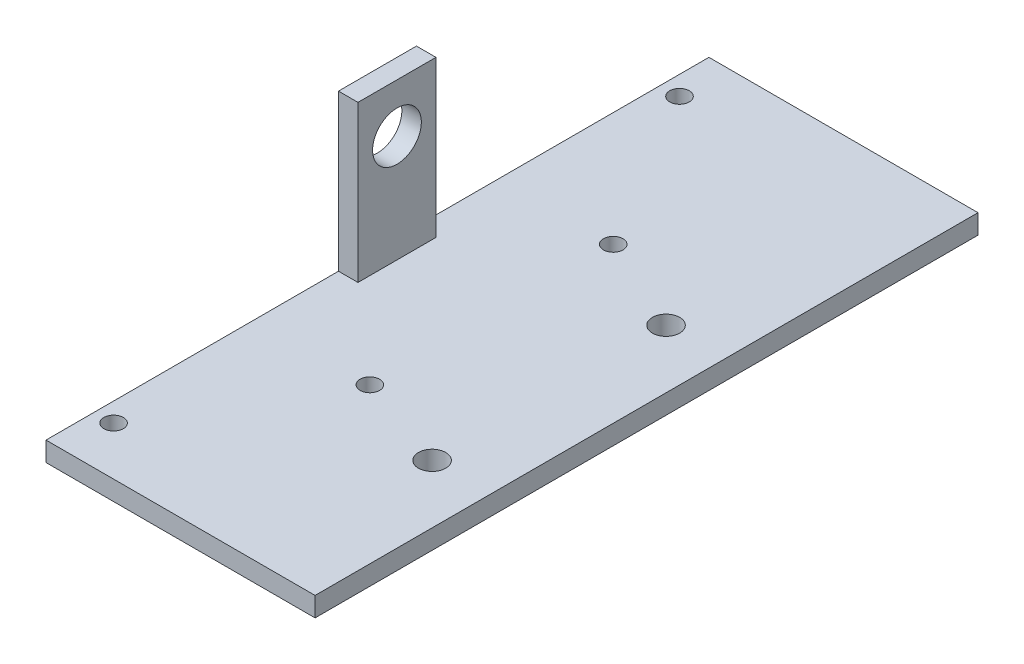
ISO-10303-21;
HEADER;
FILE_DESCRIPTION(('STEP AP214'),'2;1');
FILE_NAME('part.step','',(''),(''),'','','');
FILE_SCHEMA(('AUTOMOTIVE_DESIGN { 1 0 10303 214 1 1 1 1 }'));
ENDSEC;
DATA;
#1=APPLICATION_CONTEXT('core data for automotive mechanical design processes');
#2=APPLICATION_PROTOCOL_DEFINITION('international standard','automotive_design',2000,#1);
#3=PRODUCT_CONTEXT('',#1,'mechanical');
#4=PRODUCT('Part','Part','',(#3));
#5=PRODUCT_RELATED_PRODUCT_CATEGORY('part','',(#4));
#6=PRODUCT_DEFINITION_FORMATION('','',#4);
#7=PRODUCT_DEFINITION_CONTEXT('part definition',#1,'design');
#8=PRODUCT_DEFINITION('design','',#6,#7);
#9=PRODUCT_DEFINITION_SHAPE('','',#8);
#10=(LENGTH_UNIT() NAMED_UNIT(*) SI_UNIT(.MILLI.,.METRE.));
#11=(NAMED_UNIT(*) PLANE_ANGLE_UNIT() SI_UNIT($,.RADIAN.));
#12=(NAMED_UNIT(*) SI_UNIT($,.STERADIAN.) SOLID_ANGLE_UNIT());
#13=UNCERTAINTY_MEASURE_WITH_UNIT(LENGTH_MEASURE(1.E-05),#10,'distance_accuracy_value','');
#14=(GEOMETRIC_REPRESENTATION_CONTEXT(3) GLOBAL_UNCERTAINTY_ASSIGNED_CONTEXT((#13)) GLOBAL_UNIT_ASSIGNED_CONTEXT((#10,
#11,#12)) REPRESENTATION_CONTEXT('',''));
#15=CARTESIAN_POINT('',(0.,0.,0.));
#16=DIRECTION('',(0.,0.,1.));
#17=DIRECTION('',(1.,0.,0.));
#18=AXIS2_PLACEMENT_3D('',#15,#16,#17);
#19=CARTESIAN_POINT('',(0.,0.,-170.));
#20=DIRECTION('',(0.,-1.,0.));
#21=DIRECTION('',(0.,0.,-1.));
#22=AXIS2_PLACEMENT_3D('',#19,#20,#21);
#23=PLANE('',#22);
#24=CARTESIAN_POINT('',(54.,0.,-45.));
#25=DIRECTION('',(0.,1.,0.));
#26=DIRECTION('',(0.,0.,1.));
#27=AXIS2_PLACEMENT_3D('',#24,#25,#26);
#28=CIRCLE('',#27,3.5);
#29=CARTESIAN_POINT('',(54.,0.,-41.5));
#30=VERTEX_POINT('',#29);
#31=EDGE_CURVE('E255',#30,#30,#28,.T.);
#32=ORIENTED_EDGE('',*,*,#31,.T.);
#33=EDGE_LOOP('',(#32));
#34=FACE_BOUND('',#33,.T.);
#35=CARTESIAN_POINT('',(54.,0.,-105.));
#36=DIRECTION('',(0.,1.,0.));
#37=DIRECTION('',(0.,0.,1.));
#38=AXIS2_PLACEMENT_3D('',#35,#36,#37);
#39=CIRCLE('',#38,3.5);
#40=CARTESIAN_POINT('',(54.,0.,-101.5));
#41=VERTEX_POINT('',#40);
#42=EDGE_CURVE('E251',#41,#41,#39,.T.);
#43=ORIENTED_EDGE('',*,*,#42,.T.);
#44=EDGE_LOOP('',(#43));
#45=FACE_BOUND('',#44,.T.);
#46=CARTESIAN_POINT('',(4.89511383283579,6.10622663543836E-13,-12.4401509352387));
#47=DIRECTION('',(0.,1.,0.));
#48=DIRECTION('',(0.,0.,1.));
#49=AXIS2_PLACEMENT_3D('',#46,#47,#48);
#50=CIRCLE('',#49,2.5);
#51=CARTESIAN_POINT('',(4.89511383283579,6.10622663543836E-13,-9.94015093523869));
#52=VERTEX_POINT('',#51);
#53=EDGE_CURVE('E236',#52,#52,#50,.T.);
#54=ORIENTED_EDGE('',*,*,#53,.T.);
#55=EDGE_LOOP('',(#54));
#56=FACE_BOUND('',#55,.T.);
#57=CARTESIAN_POINT('',(29.2569552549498,0.,-116.201649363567));
#58=DIRECTION('',(0.,1.,0.));
#59=DIRECTION('',(0.,0.,1.));
#60=AXIS2_PLACEMENT_3D('',#57,#58,#59);
#61=CIRCLE('',#60,2.5);
#62=CARTESIAN_POINT('',(29.2569552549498,0.,-113.701649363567));
#63=VERTEX_POINT('',#62);
#64=EDGE_CURVE('E228',#63,#63,#61,.T.);
#65=ORIENTED_EDGE('',*,*,#64,.T.);
#66=EDGE_LOOP('',(#65));
#67=FACE_BOUND('',#66,.T.);
#68=CARTESIAN_POINT('',(4.89511383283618,0.,-157.55984906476));
#69=DIRECTION('',(0.,1.,0.));
#70=DIRECTION('',(0.,0.,1.));
#71=AXIS2_PLACEMENT_3D('',#68,#69,#70);
#72=CIRCLE('',#71,2.5);
#73=CARTESIAN_POINT('',(4.89511383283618,0.,-155.05984906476));
#74=VERTEX_POINT('',#73);
#75=EDGE_CURVE('E167',#74,#74,#72,.T.);
#76=ORIENTED_EDGE('',*,*,#75,.T.);
#77=EDGE_LOOP('',(#76));
#78=FACE_BOUND('',#77,.T.);
#79=DIRECTION('',(1.,0.,0.));
#80=VECTOR('',#79,1.);
#81=CARTESIAN_POINT('',(0.,0.,0.));
#82=LINE('',#81,#80);
#83=CARTESIAN_POINT('',(0.,0.,0.));
#84=VERTEX_POINT('',#83);
#85=CARTESIAN_POINT('',(69.,0.,3.19189119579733E-13));
#86=VERTEX_POINT('',#85);
#87=EDGE_CURVE('E117',#84,#86,#82,.T.);
#88=ORIENTED_EDGE('',*,*,#87,.F.);
#89=DIRECTION('',(0.,0.,1.));
#90=VECTOR('',#89,1.);
#91=CARTESIAN_POINT('',(0.,0.,-170.));
#92=LINE('',#91,#90);
#93=CARTESIAN_POINT('',(0.,0.,-170.));
#94=VERTEX_POINT('',#93);
#95=EDGE_CURVE('E25',#94,#84,#92,.T.);
#96=ORIENTED_EDGE('',*,*,#95,.F.);
#97=DIRECTION('',(1.,0.,0.));
#98=VECTOR('',#97,1.);
#99=CARTESIAN_POINT('',(0.,0.,-170.));
#100=LINE('',#99,#98);
#101=CARTESIAN_POINT('',(69.,6.38378239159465E-13,-170.));
#102=VERTEX_POINT('',#101);
#103=EDGE_CURVE('E123',#94,#102,#100,.T.);
#104=ORIENTED_EDGE('',*,*,#103,.T.);
#105=DIRECTION('',(0.,0.,1.));
#106=VECTOR('',#105,1.);
#107=CARTESIAN_POINT('',(69.,6.38378239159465E-13,-170.));
#108=LINE('',#107,#106);
#109=EDGE_CURVE('E11',#102,#86,#108,.T.);
#110=ORIENTED_EDGE('',*,*,#109,.T.);
#111=EDGE_LOOP('',(#88,#96,#104,#110));
#112=FACE_BOUND('',#111,.T.);
#113=CARTESIAN_POINT('',(29.2569552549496,0.,-53.7983506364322));
#114=DIRECTION('',(0.,1.,0.));
#115=DIRECTION('',(0.,0.,1.));
#116=AXIS2_PLACEMENT_3D('',#113,#114,#115);
#117=CIRCLE('',#116,2.5);
#118=CARTESIAN_POINT('',(29.2569552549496,0.,-51.2983506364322));
#119=VERTEX_POINT('',#118);
#120=EDGE_CURVE('E240',#119,#119,#117,.T.);
#121=ORIENTED_EDGE('',*,*,#120,.T.);
#122=EDGE_LOOP('',(#121));
#123=FACE_BOUND('',#122,.T.);
#124=ADVANCED_FACE('F16',(#34,#45,#56,#67,#78,#112,#123),#23,.T.);
#125=CARTESIAN_POINT('',(69.,6.38378239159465E-13,-170.));
#126=DIRECTION('',(1.,0.,0.));
#127=DIRECTION('',(0.,0.,-1.));
#128=AXIS2_PLACEMENT_3D('',#125,#126,#127);
#129=PLANE('',#128);
#130=DIRECTION('',(0.,1.,0.));
#131=VECTOR('',#130,1.);
#132=CARTESIAN_POINT('',(69.,0.,3.19189119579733E-13));
#133=LINE('',#132,#131);
#134=CARTESIAN_POINT('',(69.,5.,0.));
#135=VERTEX_POINT('',#134);
#136=EDGE_CURVE('E102',#86,#135,#133,.T.);
#137=ORIENTED_EDGE('',*,*,#136,.F.);
#138=ORIENTED_EDGE('',*,*,#109,.F.);
#139=DIRECTION('',(0.,1.,0.));
#140=VECTOR('',#139,1.);
#141=CARTESIAN_POINT('',(69.,6.38378239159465E-13,-170.));
#142=LINE('',#141,#140);
#143=CARTESIAN_POINT('',(69.,5.00000000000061,-170.));
#144=VERTEX_POINT('',#143);
#145=EDGE_CURVE('E113',#102,#144,#142,.T.);
#146=ORIENTED_EDGE('',*,*,#145,.T.);
#147=DIRECTION('',(0.,0.,1.));
#148=VECTOR('',#147,1.);
#149=CARTESIAN_POINT('',(69.,5.00000000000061,-170.));
#150=LINE('',#149,#148);
#151=EDGE_CURVE('E125',#144,#135,#150,.T.);
#152=ORIENTED_EDGE('',*,*,#151,.T.);
#153=EDGE_LOOP('',(#137,#138,#146,#152));
#154=FACE_BOUND('',#153,.T.);
#155=ADVANCED_FACE('F18',(#154),#129,.T.);
#156=CARTESIAN_POINT('',(0.,5.,-170.));
#157=DIRECTION('',(-1.,0.,0.));
#158=DIRECTION('',(0.,0.,1.));
#159=AXIS2_PLACEMENT_3D('',#156,#157,#158);
#160=PLANE('',#159);
#161=CARTESIAN_POINT('',(0.,32.5,-85.));
#162=DIRECTION('',(-1.,0.,0.));
#163=DIRECTION('',(0.,0.,1.));
#164=AXIS2_PLACEMENT_3D('',#161,#162,#163);
#165=CIRCLE('',#164,6.25);
#166=CARTESIAN_POINT('',(0.,32.5,-78.75));
#167=VERTEX_POINT('',#166);
#168=EDGE_CURVE('E247',#167,#167,#165,.T.);
#169=ORIENTED_EDGE('',*,*,#168,.F.);
#170=EDGE_LOOP('',(#169));
#171=FACE_BOUND('',#170,.T.);
#172=DIRECTION('',(0.,-1.,0.));
#173=VECTOR('',#172,1.);
#174=CARTESIAN_POINT('',(0.,5.,0.));
#175=LINE('',#174,#173);
#176=CARTESIAN_POINT('',(0.,5.,0.));
#177=VERTEX_POINT('',#176);
#178=EDGE_CURVE('E129',#177,#84,#175,.T.);
#179=ORIENTED_EDGE('',*,*,#178,.F.);
#180=DIRECTION('',(0.,0.,1.));
#181=VECTOR('',#180,1.);
#182=CARTESIAN_POINT('',(0.,5.,-170.));
#183=LINE('',#182,#181);
#184=CARTESIAN_POINT('',(0.,5.,-75.));
#185=VERTEX_POINT('',#184);
#186=EDGE_CURVE('E141',#185,#177,#183,.T.);
#187=ORIENTED_EDGE('',*,*,#186,.F.);
#188=DIRECTION('',(0.,-1.,0.));
#189=VECTOR('',#188,1.);
#190=CARTESIAN_POINT('',(3.19189119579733E-13,45.,-75.));
#191=LINE('',#190,#189);
#192=CARTESIAN_POINT('',(3.19189119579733E-13,45.,-75.));
#193=VERTEX_POINT('',#192);
#194=EDGE_CURVE('E107',#193,#185,#191,.T.);
#195=ORIENTED_EDGE('',*,*,#194,.F.);
#196=DIRECTION('',(0.,0.,1.));
#197=VECTOR('',#196,1.);
#198=CARTESIAN_POINT('',(3.19189119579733E-13,45.,-75.));
#199=LINE('',#198,#197);
#200=CARTESIAN_POINT('',(0.,45.,-95.));
#201=VERTEX_POINT('',#200);
#202=EDGE_CURVE('E89',#201,#193,#199,.T.);
#203=ORIENTED_EDGE('',*,*,#202,.F.);
#204=DIRECTION('',(0.,-1.,0.));
#205=VECTOR('',#204,1.);
#206=CARTESIAN_POINT('',(0.,45.,-95.));
#207=LINE('',#206,#205);
#208=CARTESIAN_POINT('',(0.,5.00000000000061,-95.));
#209=VERTEX_POINT('',#208);
#210=EDGE_CURVE('E86',#201,#209,#207,.T.);
#211=ORIENTED_EDGE('',*,*,#210,.T.);
#212=CARTESIAN_POINT('',(0.,5.,-170.));
#213=VERTEX_POINT('',#212);
#214=EDGE_CURVE('E135',#213,#209,#183,.T.);
#215=ORIENTED_EDGE('',*,*,#214,.F.);
#216=DIRECTION('',(0.,-1.,0.));
#217=VECTOR('',#216,1.);
#218=CARTESIAN_POINT('',(0.,5.,-170.));
#219=LINE('',#218,#217);
#220=EDGE_CURVE('E120',#213,#94,#219,.T.);
#221=ORIENTED_EDGE('',*,*,#220,.T.);
#222=ORIENTED_EDGE('',*,*,#95,.T.);
#223=EDGE_LOOP('',(#179,#187,#195,#203,#211,#215,#221,#222));
#224=FACE_BOUND('',#223,.T.);
#225=ADVANCED_FACE('F161',(#171,#224),#160,.T.);
#226=CARTESIAN_POINT('',(69.,5.00000000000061,-170.));
#227=DIRECTION('',(0.,1.,0.));
#228=DIRECTION('',(-1.,0.,0.));
#229=AXIS2_PLACEMENT_3D('',#226,#227,#228);
#230=PLANE('',#229);
#231=CARTESIAN_POINT('',(54.,5.,-45.));
#232=DIRECTION('',(0.,1.,0.));
#233=DIRECTION('',(0.,0.,1.));
#234=AXIS2_PLACEMENT_3D('',#231,#232,#233);
#235=CIRCLE('',#234,3.5);
#236=CARTESIAN_POINT('',(54.,5.,-41.5));
#237=VERTEX_POINT('',#236);
#238=EDGE_CURVE('E207',#237,#237,#235,.T.);
#239=ORIENTED_EDGE('',*,*,#238,.F.);
#240=EDGE_LOOP('',(#239));
#241=FACE_BOUND('',#240,.T.);
#242=CARTESIAN_POINT('',(54.,5.,-105.));
#243=DIRECTION('',(0.,1.,0.));
#244=DIRECTION('',(0.,0.,1.));
#245=AXIS2_PLACEMENT_3D('',#242,#243,#244);
#246=CIRCLE('',#245,3.5);
#247=CARTESIAN_POINT('',(54.,5.,-101.5));
#248=VERTEX_POINT('',#247);
#249=EDGE_CURVE('E211',#248,#248,#246,.T.);
#250=ORIENTED_EDGE('',*,*,#249,.F.);
#251=EDGE_LOOP('',(#250));
#252=FACE_BOUND('',#251,.T.);
#253=CARTESIAN_POINT('',(29.2569552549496,5.,-53.7983506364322));
#254=DIRECTION('',(0.,1.,0.));
#255=DIRECTION('',(0.,0.,1.));
#256=AXIS2_PLACEMENT_3D('',#253,#254,#255);
#257=CIRCLE('',#256,2.5);
#258=CARTESIAN_POINT('',(29.2569552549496,5.,-51.2983506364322));
#259=VERTEX_POINT('',#258);
#260=EDGE_CURVE('E215',#259,#259,#257,.T.);
#261=ORIENTED_EDGE('',*,*,#260,.F.);
#262=EDGE_LOOP('',(#261));
#263=FACE_BOUND('',#262,.T.);
#264=CARTESIAN_POINT('',(4.89511383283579,5.00000000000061,-12.440150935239));
#265=DIRECTION('',(0.,1.,0.));
#266=DIRECTION('',(0.,0.,1.));
#267=AXIS2_PLACEMENT_3D('',#264,#265,#266);
#268=CIRCLE('',#267,2.5);
#269=CARTESIAN_POINT('',(4.89511383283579,5.00000000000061,-9.94015093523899));
#270=VERTEX_POINT('',#269);
#271=EDGE_CURVE('E219',#270,#270,#268,.T.);
#272=ORIENTED_EDGE('',*,*,#271,.F.);
#273=EDGE_LOOP('',(#272));
#274=FACE_BOUND('',#273,.T.);
#275=CARTESIAN_POINT('',(29.2569552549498,5.,-116.201649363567));
#276=DIRECTION('',(0.,1.,0.));
#277=DIRECTION('',(0.,0.,1.));
#278=AXIS2_PLACEMENT_3D('',#275,#276,#277);
#279=CIRCLE('',#278,2.5);
#280=CARTESIAN_POINT('',(29.2569552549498,5.,-113.701649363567));
#281=VERTEX_POINT('',#280);
#282=EDGE_CURVE('E223',#281,#281,#279,.T.);
#283=ORIENTED_EDGE('',*,*,#282,.F.);
#284=EDGE_LOOP('',(#283));
#285=FACE_BOUND('',#284,.T.);
#286=CARTESIAN_POINT('',(4.89511383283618,5.,-157.55984906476));
#287=DIRECTION('',(0.,1.,0.));
#288=DIRECTION('',(0.,0.,1.));
#289=AXIS2_PLACEMENT_3D('',#286,#287,#288);
#290=CIRCLE('',#289,2.5);
#291=CARTESIAN_POINT('',(4.89511383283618,5.,-155.05984906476));
#292=VERTEX_POINT('',#291);
#293=EDGE_CURVE('E226',#292,#292,#290,.T.);
#294=ORIENTED_EDGE('',*,*,#293,.F.);
#295=EDGE_LOOP('',(#294));
#296=FACE_BOUND('',#295,.T.);
#297=DIRECTION('',(1.,0.,0.));
#298=VECTOR('',#297,1.);
#299=CARTESIAN_POINT('',(5.,5.,-75.));
#300=LINE('',#299,#298);
#301=CARTESIAN_POINT('',(5.,5.,-75.));
#302=VERTEX_POINT('',#301);
#303=EDGE_CURVE('E99',#185,#302,#300,.T.);
#304=ORIENTED_EDGE('',*,*,#303,.F.);
#305=ORIENTED_EDGE('',*,*,#186,.T.);
#306=DIRECTION('',(-1.,0.,0.));
#307=VECTOR('',#306,1.);
#308=CARTESIAN_POINT('',(69.,5.,0.));
#309=LINE('',#308,#307);
#310=EDGE_CURVE('E105',#135,#177,#309,.T.);
#311=ORIENTED_EDGE('',*,*,#310,.F.);
#312=ORIENTED_EDGE('',*,*,#151,.F.);
#313=DIRECTION('',(-1.,0.,0.));
#314=VECTOR('',#313,1.);
#315=CARTESIAN_POINT('',(69.,5.00000000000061,-170.));
#316=LINE('',#315,#314);
#317=EDGE_CURVE('E116',#144,#213,#316,.T.);
#318=ORIENTED_EDGE('',*,*,#317,.T.);
#319=ORIENTED_EDGE('',*,*,#214,.T.);
#320=DIRECTION('',(-1.,0.,0.));
#321=VECTOR('',#320,1.);
#322=CARTESIAN_POINT('',(5.,5.00000000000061,-95.));
#323=LINE('',#322,#321);
#324=CARTESIAN_POINT('',(5.,5.00000000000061,-95.));
#325=VERTEX_POINT('',#324);
#326=EDGE_CURVE('E38',#325,#209,#323,.T.);
#327=ORIENTED_EDGE('',*,*,#326,.F.);
#328=DIRECTION('',(0.,0.,-1.));
#329=VECTOR('',#328,1.);
#330=CARTESIAN_POINT('',(5.,5.,-75.));
#331=LINE('',#330,#329);
#332=EDGE_CURVE('E33',#302,#325,#331,.T.);
#333=ORIENTED_EDGE('',*,*,#332,.F.);
#334=EDGE_LOOP('',(#304,#305,#311,#312,#318,#319,#327,#333));
#335=FACE_BOUND('',#334,.T.);
#336=ADVANCED_FACE('F150',(#241,#252,#263,#274,#285,#296,#335),#230,.T.);
#337=CARTESIAN_POINT('',(69.,6.38378239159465E-13,-170.));
#338=DIRECTION('',(0.,0.,-1.));
#339=DIRECTION('',(-1.,0.,0.));
#340=AXIS2_PLACEMENT_3D('',#337,#338,#339);
#341=PLANE('',#340);
#342=ORIENTED_EDGE('',*,*,#145,.F.);
#343=ORIENTED_EDGE('',*,*,#103,.F.);
#344=ORIENTED_EDGE('',*,*,#220,.F.);
#345=ORIENTED_EDGE('',*,*,#317,.F.);
#346=EDGE_LOOP('',(#342,#343,#344,#345));
#347=FACE_BOUND('',#346,.T.);
#348=ADVANCED_FACE('F158',(#347),#341,.T.);
#349=CARTESIAN_POINT('',(69.,0.,3.19189119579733E-13));
#350=DIRECTION('',(0.,0.,-1.));
#351=DIRECTION('',(-1.,0.,0.));
#352=AXIS2_PLACEMENT_3D('',#349,#350,#351);
#353=PLANE('',#352);
#354=ORIENTED_EDGE('',*,*,#136,.T.);
#355=ORIENTED_EDGE('',*,*,#310,.T.);
#356=ORIENTED_EDGE('',*,*,#178,.T.);
#357=ORIENTED_EDGE('',*,*,#87,.T.);
#358=EDGE_LOOP('',(#354,#355,#356,#357));
#359=FACE_BOUND('',#358,.T.);
#360=ADVANCED_FACE('F152',(#359),#353,.F.);
#361=CARTESIAN_POINT('',(5.00000000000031,45.,-75.));
#362=DIRECTION('',(-1.,0.,0.));
#363=DIRECTION('',(0.,0.,1.));
#364=AXIS2_PLACEMENT_3D('',#361,#362,#363);
#365=PLANE('',#364);
#366=CARTESIAN_POINT('',(5.,32.5,-84.9999999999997));
#367=DIRECTION('',(-1.,0.,0.));
#368=DIRECTION('',(0.,0.,1.));
#369=AXIS2_PLACEMENT_3D('',#366,#367,#368);
#370=CIRCLE('',#369,6.25);
#371=CARTESIAN_POINT('',(5.00000000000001,32.5,-78.7499999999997));
#372=VERTEX_POINT('',#371);
#373=EDGE_CURVE('E244',#372,#372,#370,.T.);
#374=ORIENTED_EDGE('',*,*,#373,.T.);
#375=EDGE_LOOP('',(#374));
#376=FACE_BOUND('',#375,.T.);
#377=ORIENTED_EDGE('',*,*,#332,.T.);
#378=DIRECTION('',(0.,-1.,0.));
#379=VECTOR('',#378,1.);
#380=CARTESIAN_POINT('',(5.,45.,-95.));
#381=LINE('',#380,#379);
#382=CARTESIAN_POINT('',(5.,45.,-95.));
#383=VERTEX_POINT('',#382);
#384=EDGE_CURVE('E84',#383,#325,#381,.T.);
#385=ORIENTED_EDGE('',*,*,#384,.F.);
#386=DIRECTION('',(0.,0.,-1.));
#387=VECTOR('',#386,1.);
#388=CARTESIAN_POINT('',(5.00000000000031,45.,-75.));
#389=LINE('',#388,#387);
#390=CARTESIAN_POINT('',(5.00000000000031,45.,-75.));
#391=VERTEX_POINT('',#390);
#392=EDGE_CURVE('E90',#391,#383,#389,.T.);
#393=ORIENTED_EDGE('',*,*,#392,.F.);
#394=DIRECTION('',(0.,-1.,0.));
#395=VECTOR('',#394,1.);
#396=CARTESIAN_POINT('',(5.00000000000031,45.,-75.));
#397=LINE('',#396,#395);
#398=EDGE_CURVE('E111',#391,#302,#397,.T.);
#399=ORIENTED_EDGE('',*,*,#398,.T.);
#400=EDGE_LOOP('',(#377,#385,#393,#399));
#401=FACE_BOUND('',#400,.T.);
#402=ADVANCED_FACE('F101',(#376,#401),#365,.F.);
#403=CARTESIAN_POINT('',(5.,45.,-95.));
#404=DIRECTION('',(0.,0.,1.));
#405=DIRECTION('',(1.,0.,0.));
#406=AXIS2_PLACEMENT_3D('',#403,#404,#405);
#407=PLANE('',#406);
#408=ORIENTED_EDGE('',*,*,#326,.T.);
#409=ORIENTED_EDGE('',*,*,#210,.F.);
#410=DIRECTION('',(-1.,0.,0.));
#411=VECTOR('',#410,1.);
#412=CARTESIAN_POINT('',(5.,45.,-95.));
#413=LINE('',#412,#411);
#414=EDGE_CURVE('E80',#383,#201,#413,.T.);
#415=ORIENTED_EDGE('',*,*,#414,.F.);
#416=ORIENTED_EDGE('',*,*,#384,.T.);
#417=EDGE_LOOP('',(#408,#409,#415,#416));
#418=FACE_BOUND('',#417,.T.);
#419=ADVANCED_FACE('F82',(#418),#407,.F.);
#420=CARTESIAN_POINT('',(5.00000000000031,45.,-75.));
#421=DIRECTION('',(0.,0.,-1.));
#422=DIRECTION('',(-1.,0.,0.));
#423=AXIS2_PLACEMENT_3D('',#420,#421,#422);
#424=PLANE('',#423);
#425=ORIENTED_EDGE('',*,*,#303,.T.);
#426=ORIENTED_EDGE('',*,*,#398,.F.);
#427=DIRECTION('',(1.,0.,0.));
#428=VECTOR('',#427,1.);
#429=CARTESIAN_POINT('',(5.00000000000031,45.,-75.));
#430=LINE('',#429,#428);
#431=EDGE_CURVE('E95',#193,#391,#430,.T.);
#432=ORIENTED_EDGE('',*,*,#431,.F.);
#433=ORIENTED_EDGE('',*,*,#194,.T.);
#434=EDGE_LOOP('',(#425,#426,#432,#433));
#435=FACE_BOUND('',#434,.T.);
#436=ADVANCED_FACE('F175',(#435),#424,.F.);
#437=CARTESIAN_POINT('',(5.,45.,-95.));
#438=DIRECTION('',(0.,1.,0.));
#439=DIRECTION('',(0.,0.,1.));
#440=AXIS2_PLACEMENT_3D('',#437,#438,#439);
#441=PLANE('',#440);
#442=ORIENTED_EDGE('',*,*,#392,.T.);
#443=ORIENTED_EDGE('',*,*,#414,.T.);
#444=ORIENTED_EDGE('',*,*,#202,.T.);
#445=ORIENTED_EDGE('',*,*,#431,.T.);
#446=EDGE_LOOP('',(#442,#443,#444,#445));
#447=FACE_BOUND('',#446,.T.);
#448=ADVANCED_FACE('F93',(#447),#441,.T.);
#449=CARTESIAN_POINT('',(4.89511383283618,5.,-157.55984906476));
#450=DIRECTION('',(0.,1.,0.));
#451=DIRECTION('',(0.,0.,1.));
#452=AXIS2_PLACEMENT_3D('',#449,#450,#451);
#453=CYLINDRICAL_SURFACE('',#452,2.5);
#454=ORIENTED_EDGE('',*,*,#75,.F.);
#455=EDGE_LOOP('',(#454));
#456=FACE_BOUND('',#455,.T.);
#457=ORIENTED_EDGE('',*,*,#293,.T.);
#458=EDGE_LOOP('',(#457));
#459=FACE_BOUND('',#458,.T.);
#460=ADVANCED_FACE('F183',(#456,#459),#453,.F.);
#461=CARTESIAN_POINT('',(29.2569552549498,5.,-116.201649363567));
#462=DIRECTION('',(0.,1.,0.));
#463=DIRECTION('',(0.,0.,1.));
#464=AXIS2_PLACEMENT_3D('',#461,#462,#463);
#465=CYLINDRICAL_SURFACE('',#464,2.5);
#466=ORIENTED_EDGE('',*,*,#64,.F.);
#467=EDGE_LOOP('',(#466));
#468=FACE_BOUND('',#467,.T.);
#469=ORIENTED_EDGE('',*,*,#282,.T.);
#470=EDGE_LOOP('',(#469));
#471=FACE_BOUND('',#470,.T.);
#472=ADVANCED_FACE('F280',(#468,#471),#465,.F.);
#473=CARTESIAN_POINT('',(4.89511383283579,5.00000000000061,-12.440150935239));
#474=DIRECTION('',(0.,1.,0.));
#475=DIRECTION('',(0.,0.,1.));
#476=AXIS2_PLACEMENT_3D('',#473,#474,#475);
#477=CYLINDRICAL_SURFACE('',#476,2.5);
#478=ORIENTED_EDGE('',*,*,#53,.F.);
#479=EDGE_LOOP('',(#478));
#480=FACE_BOUND('',#479,.T.);
#481=ORIENTED_EDGE('',*,*,#271,.T.);
#482=EDGE_LOOP('',(#481));
#483=FACE_BOUND('',#482,.T.);
#484=ADVANCED_FACE('F276',(#480,#483),#477,.F.);
#485=CARTESIAN_POINT('',(29.2569552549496,5.,-53.7983506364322));
#486=DIRECTION('',(0.,1.,0.));
#487=DIRECTION('',(0.,0.,1.));
#488=AXIS2_PLACEMENT_3D('',#485,#486,#487);
#489=CYLINDRICAL_SURFACE('',#488,2.5);
#490=ORIENTED_EDGE('',*,*,#120,.F.);
#491=EDGE_LOOP('',(#490));
#492=FACE_BOUND('',#491,.T.);
#493=ORIENTED_EDGE('',*,*,#260,.T.);
#494=EDGE_LOOP('',(#493));
#495=FACE_BOUND('',#494,.T.);
#496=ADVANCED_FACE('F272',(#492,#495),#489,.F.);
#497=CARTESIAN_POINT('',(0.,32.5,-85.));
#498=DIRECTION('',(-1.,0.,0.));
#499=DIRECTION('',(0.,0.,1.));
#500=AXIS2_PLACEMENT_3D('',#497,#498,#499);
#501=CYLINDRICAL_SURFACE('',#500,6.25);
#502=ORIENTED_EDGE('',*,*,#168,.T.);
#503=EDGE_LOOP('',(#502));
#504=FACE_BOUND('',#503,.T.);
#505=ORIENTED_EDGE('',*,*,#373,.F.);
#506=EDGE_LOOP('',(#505));
#507=FACE_BOUND('',#506,.T.);
#508=ADVANCED_FACE('F266',(#504,#507),#501,.F.);
#509=CARTESIAN_POINT('',(54.,5.,-105.));
#510=DIRECTION('',(0.,1.,0.));
#511=DIRECTION('',(0.,0.,1.));
#512=AXIS2_PLACEMENT_3D('',#509,#510,#511);
#513=CYLINDRICAL_SURFACE('',#512,3.5);
#514=ORIENTED_EDGE('',*,*,#42,.F.);
#515=EDGE_LOOP('',(#514));
#516=FACE_BOUND('',#515,.T.);
#517=ORIENTED_EDGE('',*,*,#249,.T.);
#518=EDGE_LOOP('',(#517));
#519=FACE_BOUND('',#518,.T.);
#520=ADVANCED_FACE('F261',(#516,#519),#513,.F.);
#521=CARTESIAN_POINT('',(54.,5.,-45.));
#522=DIRECTION('',(0.,1.,0.));
#523=DIRECTION('',(0.,0.,1.));
#524=AXIS2_PLACEMENT_3D('',#521,#522,#523);
#525=CYLINDRICAL_SURFACE('',#524,3.5);
#526=ORIENTED_EDGE('',*,*,#31,.F.);
#527=EDGE_LOOP('',(#526));
#528=FACE_BOUND('',#527,.T.);
#529=ORIENTED_EDGE('',*,*,#238,.T.);
#530=EDGE_LOOP('',(#529));
#531=FACE_BOUND('',#530,.T.);
#532=ADVANCED_FACE('F258',(#528,#531),#525,.F.);
#533=CLOSED_SHELL('',(#124,#155,#225,#336,#348,#360,#402,#419,#436,#448,#460,#472,#484,#496,
#508,#520,#532));
#534=MANIFOLD_SOLID_BREP('B1',#533);
#535=ADVANCED_BREP_SHAPE_REPRESENTATION('',(#18,#534),#14);
#536=SHAPE_DEFINITION_REPRESENTATION(#9,#535);
ENDSEC;
END-ISO-10303-21;
